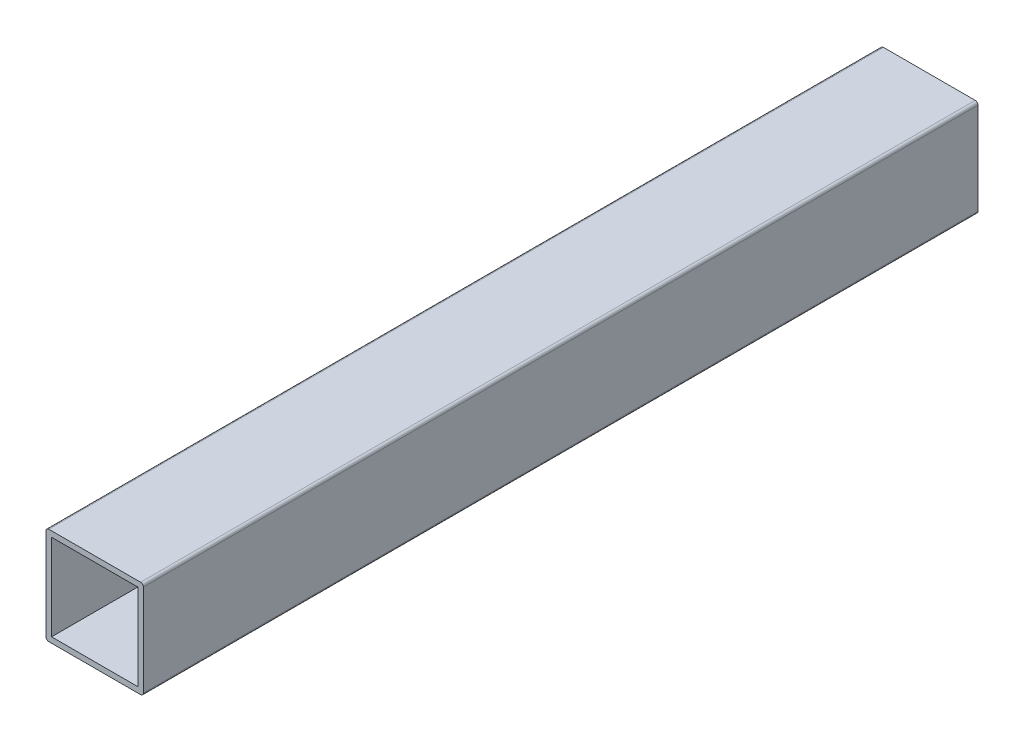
from build123d import *

# Parameters (mm, degrees)
ESQUISSE1_W            = 31
ESQUISSE1_H            = 31
BASE_EXTRU_MINCE_DEPTH = 300


with BuildPart() as part:
    # Esquisse1 → Base-Extru.-Mince (new body)
    with BuildSketch(Plane.XY):
        with BuildLine():
            Line((16.5, -17.5), (-16.5, -17.5))
            ThreePointArc((-16.5, -17.5), (-17.207106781, -17.207106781), (-17.5, -16.5))
            Line((-17.5, -16.5), (-17.5, 16.5))
            ThreePointArc((-17.5, 16.5), (-17.207106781, 17.207106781), (-16.5, 17.5))
            Line((-16.5, 17.5), (16.5, 17.5))
            ThreePointArc((16.5, 17.5), (17.207106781, 17.207106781), (17.5, 16.5))
            Line((17.5, 16.5), (17.5, -16.5))
            ThreePointArc((17.5, -16.5), (17.207106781, -17.207106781), (16.5, -17.5))
        make_face()
        Rectangle(ESQUISSE1_W, ESQUISSE1_H, mode=Mode.SUBTRACT)
    extrude(amount=BASE_EXTRU_MINCE_DEPTH)


solid = part.part
